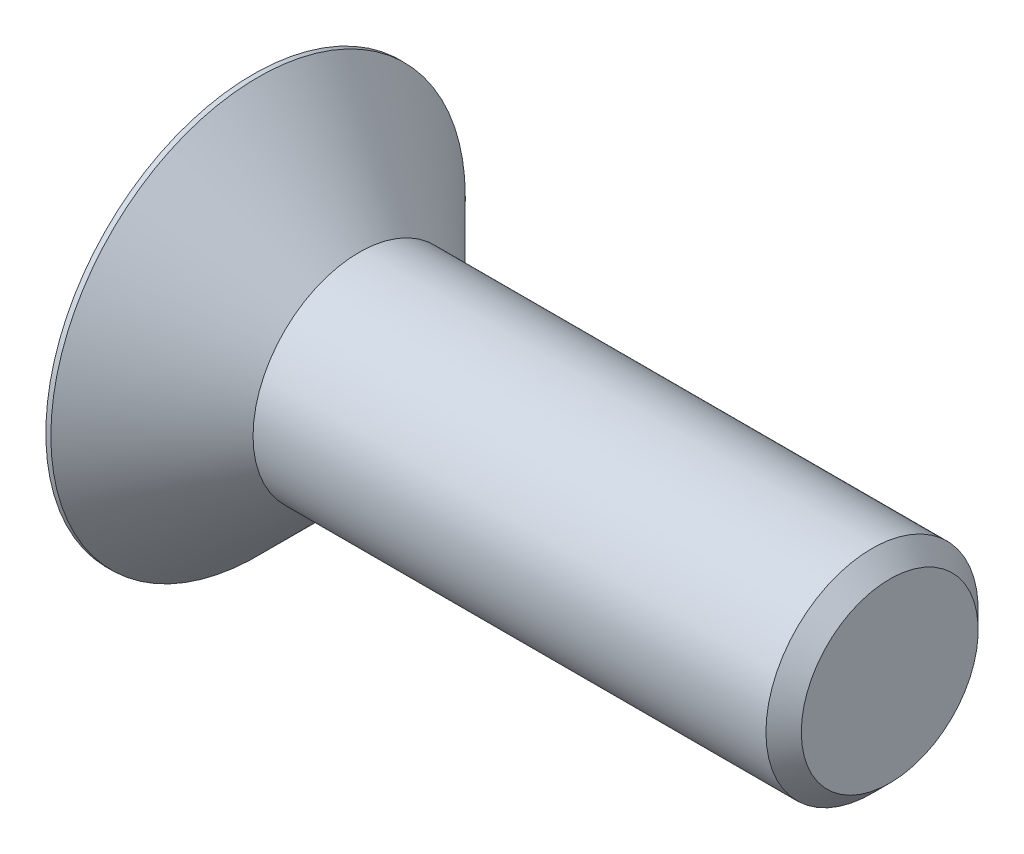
from build123d import *

# Parameters (mm, degrees)
FASE1_SIZE                      = 0.5
SCHNITT_LINEAR_AUSTRAGEN1_DEPTH = 2.5
FASE2_SIZE                      = 0.2
FASE2_SIZE2                     = 0.141421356


with BuildPart() as part:
    # Skizze1 → Rotation1 (revolve)
    with BuildSketch(Plane.XY, mode=Mode.PRIVATE) as rotation1_sk:
        Polygon((0, 0), (0, 6), (3, 3), (18, 3), (18, 0), align=None)
    revolve(rotation1_sk.sketch.rotate(Axis((0, 0, 0), (1, 0, 0)), 90), axis=Axis((0, 0, 0), (1, 0, 0)))

    # Fase1
    fase1_edges = [part.edges().sort_by_distance(p)[0] for p in [
        (18, 0, -3),
    ]]
    chamfer(fase1_edges, length=FASE1_SIZE)

    # Skizze2 → Schnitt-Linear austragen1 (cut)
    with BuildSketch(Plane.ZY):
        Polygon((1.997782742, 1.447373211), (-0.254570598, 2.453817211), (-2.25235334, 1.006444), (-1.997782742, -1.447373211), (0.254570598, -2.453817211), (2.25235334, -1.006444), align=None)
    extrude(amount=-SCHNITT_LINEAR_AUSTRAGEN1_DEPTH, mode=Mode.SUBTRACT)

    # Fase2
    fase2_edges = [part.edges().sort_by_distance(p)[0] for p in [
        (0, 0, -6),
    ]]
    fase2_side = [part.faces().sort_by_distance(p)[0] for p in [
        (1.5, 0, -4.5),
    ]]
    chamfer(fase2_edges, length=FASE2_SIZE, length2=FASE2_SIZE2, reference=fase2_side[0])


solid = part.part
